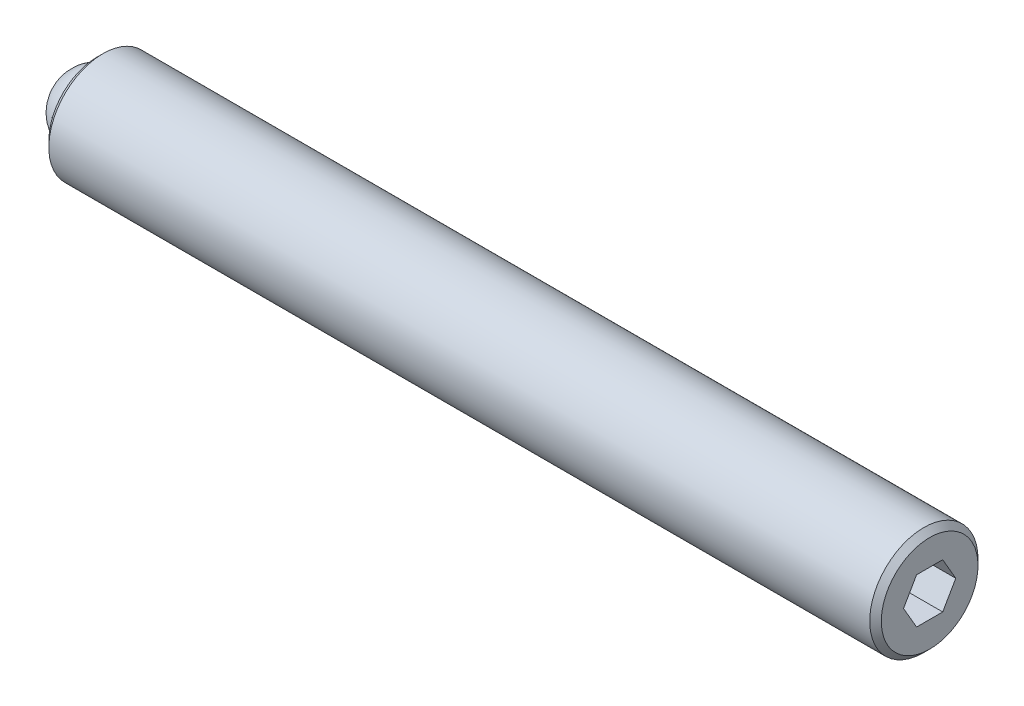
from build123d import *

# Parameters (mm, degrees)
SKETCH2_R           = 2.3749
BOSS_EXTRUDE1_DEPTH = 36.5125
CHAMFER1_SIZE       = 0.254
CHAMFER2_SIZE       = 0.254
CUT_EXTRUDE2_DEPTH  = 2.286
SKETCH3_R           = 1.5875
CUT_EXTRUDE3_DEPTH  = 1.5875
CUT_EXTRUDE6_DEPTH  = 1.5875


with BuildPart() as part:
    # Sketch2 → Boss-Extrude1 (new body)
    with BuildSketch(Plane(origin=(0, 0, 0), x_dir=(0, 0, -1), z_dir=(1, 0, 0))):
        Circle(SKETCH2_R)
    extrude(amount=BOSS_EXTRUDE1_DEPTH)

    # Chamfer1
    chamfer1_edges = [part.edges().sort_by_distance(p)[0] for p in [
        (0, 0, 2.3749),
    ]]
    chamfer(chamfer1_edges, length=CHAMFER1_SIZE)

    # Chamfer2
    chamfer2_edges = [part.edges().sort_by_distance(p)[0] for p in [
        (36.5125, 0, 2.3749),
    ]]
    chamfer(chamfer2_edges, length=CHAMFER2_SIZE)

    # Sketch4 → Cut-Extrude2 (cut)
    with BuildSketch(Plane(origin=(36.5125, 0, 0), x_dir=(0, 0, -1), z_dir=(1, 0, 0))):
        Polygon((1.14567944, 0), (0.57283972, 0.9921875), (-0.57283972, 0.9921875), (-1.14567944, 0), (-0.57283972, -0.9921875), (0.57283972, -0.9921875), align=None)
    extrude(amount=-CUT_EXTRUDE2_DEPTH, mode=Mode.SUBTRACT)

    # Sketch3 → Cut-Extrude3 (cut)
    with BuildSketch(Plane.ZY):
        Circle(SKETCH3_R)
    extrude(amount=-CUT_EXTRUDE3_DEPTH, mode=Mode.SUBTRACT)

    # Sketch6 → Cut-Extrude6 (cut)
    with BuildSketch(Plane.ZY):
        with BuildLine():
            ThreePointArc((0.063487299, 1.58623), (0, 1.5875), (-0.063487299, 1.58623))
            ThreePointArc((-0.063487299, 1.58623), (0, 1.651), (0.063487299, 1.58623))
        make_face()
    extrude(amount=-CUT_EXTRUDE6_DEPTH, mode=Mode.SUBTRACT)


with BuildPart() as body_2:
    # Sketch5 → Revolve1 (revolve)
    with BuildSketch(Plane.ZY):
        with BuildLine():
            Line((0, 0), (0, -1.5875))
            ThreePointArc((0, -1.5875), (-1.5875, 0), (0, 1.5875))
            Line((0, 1.5875), (0, 0))
        make_face()
    revolve(axis=Axis((0, 0, 0), (0, 1, 0)))


solid = Compound([part.part, body_2.part])
